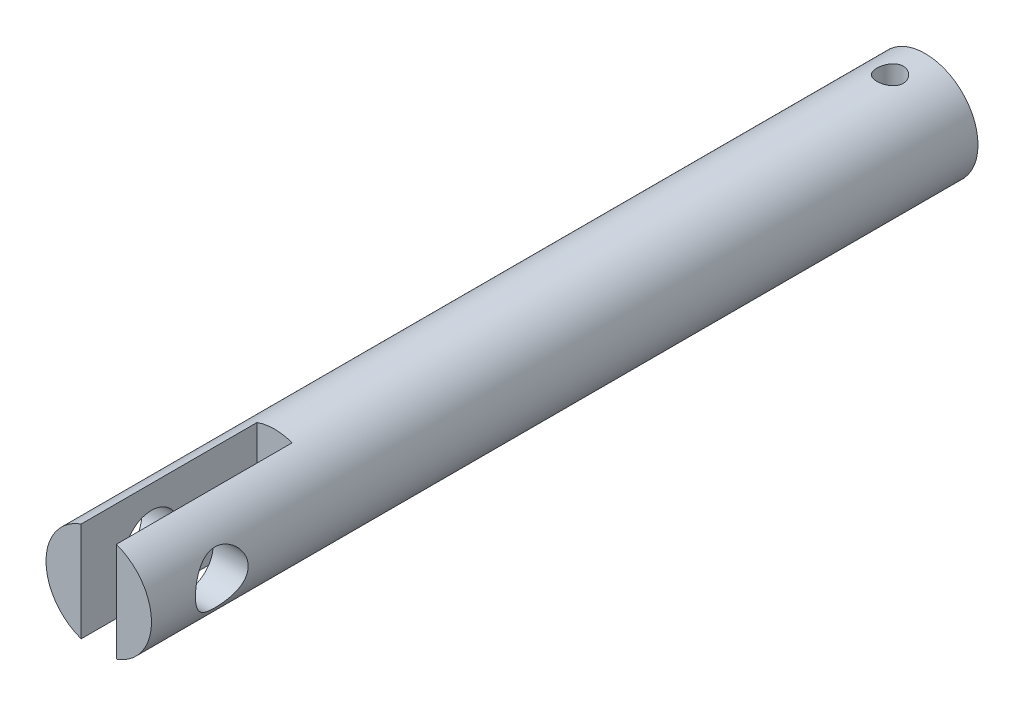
ISO-10303-21;
HEADER;
FILE_DESCRIPTION(('STEP AP214'),'2;1');
FILE_NAME('part.step','',(''),(''),'','','');
FILE_SCHEMA(('AUTOMOTIVE_DESIGN { 1 0 10303 214 1 1 1 1 }'));
ENDSEC;
DATA;
#1=APPLICATION_CONTEXT('core data for automotive mechanical design processes');
#2=APPLICATION_PROTOCOL_DEFINITION('international standard','automotive_design',2000,#1);
#3=PRODUCT_CONTEXT('',#1,'mechanical');
#4=PRODUCT('Part','Part','',(#3));
#5=PRODUCT_RELATED_PRODUCT_CATEGORY('part','',(#4));
#6=PRODUCT_DEFINITION_FORMATION('','',#4);
#7=PRODUCT_DEFINITION_CONTEXT('part definition',#1,'design');
#8=PRODUCT_DEFINITION('design','',#6,#7);
#9=PRODUCT_DEFINITION_SHAPE('','',#8);
#10=(LENGTH_UNIT() NAMED_UNIT(*) SI_UNIT(.MILLI.,.METRE.));
#11=(NAMED_UNIT(*) PLANE_ANGLE_UNIT() SI_UNIT($,.RADIAN.));
#12=(NAMED_UNIT(*) SI_UNIT($,.STERADIAN.) SOLID_ANGLE_UNIT());
#13=UNCERTAINTY_MEASURE_WITH_UNIT(LENGTH_MEASURE(1.E-05),#10,'distance_accuracy_value','');
#14=(GEOMETRIC_REPRESENTATION_CONTEXT(3) GLOBAL_UNCERTAINTY_ASSIGNED_CONTEXT((#13)) GLOBAL_UNIT_ASSIGNED_CONTEXT((#10,
#11,#12)) REPRESENTATION_CONTEXT('',''));
#15=CARTESIAN_POINT('',(0.,0.,0.));
#16=DIRECTION('',(0.,0.,1.));
#17=DIRECTION('',(1.,0.,0.));
#18=AXIS2_PLACEMENT_3D('',#15,#16,#17);
#19=CARTESIAN_POINT('',(0.,0.,74.6125));
#20=DIRECTION('',(0.,0.,1.));
#21=DIRECTION('',(1.,0.,0.));
#22=AXIS2_PLACEMENT_3D('',#19,#20,#21);
#23=PLANE('',#22);
#24=DIRECTION('',(0.,-1.,0.));
#25=VECTOR('',#24,1.);
#26=CARTESIAN_POINT('',(-1.58749999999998,0.,74.6125));
#27=LINE('',#26,#25);
#28=CARTESIAN_POINT('',(-1.58749999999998,4.49012806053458,74.6125));
#29=VERTEX_POINT('',#28);
#30=CARTESIAN_POINT('',(-1.58749999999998,-4.49012806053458,74.6125));
#31=VERTEX_POINT('',#30);
#32=EDGE_CURVE('E139',#29,#31,#27,.T.);
#33=ORIENTED_EDGE('',*,*,#32,.F.);
#34=CARTESIAN_POINT('',(0.,0.,74.6125));
#35=DIRECTION('',(0.,0.,1.));
#36=DIRECTION('',(1.,0.,0.));
#37=AXIS2_PLACEMENT_3D('',#34,#35,#36);
#38=CIRCLE('',#37,4.7625);
#39=EDGE_CURVE('E103',#29,#31,#38,.T.);
#40=ORIENTED_EDGE('',*,*,#39,.T.);
#41=EDGE_LOOP('',(#33,#40));
#42=FACE_BOUND('',#41,.T.);
#43=ADVANCED_FACE('F34',(#42),#23,.T.);
#44=CARTESIAN_POINT('',(0.,0.,74.6125));
#45=DIRECTION('',(0.,0.,-1.));
#46=DIRECTION('',(-1.,0.,0.));
#47=AXIS2_PLACEMENT_3D('',#44,#45,#46);
#48=CYLINDRICAL_SURFACE('',#47,4.7625);
#49=CARTESIAN_POINT('',(-4.7625,0.,65.88125));
#50=CARTESIAN_POINT('',(-4.76249216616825,0.125183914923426,65.8812592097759));
#51=CARTESIAN_POINT('',(-4.75751079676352,0.250522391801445,65.8911803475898));
#52=CARTESIAN_POINT('',(-4.73807236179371,0.497492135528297,65.9304293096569));
#53=CARTESIAN_POINT('',(-4.72359730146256,0.619115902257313,65.9597939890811));
#54=CARTESIAN_POINT('',(-4.68668758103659,0.854710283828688,66.0364928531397));
#55=CARTESIAN_POINT('',(-4.66428387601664,0.968708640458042,66.083757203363));
#56=CARTESIAN_POINT('',(-4.6135713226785,1.18698797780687,66.1945525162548));
#57=CARTESIAN_POINT('',(-4.58526293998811,1.29126972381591,66.2580821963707));
#58=CARTESIAN_POINT('',(-4.52333339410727,1.49425297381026,66.4039754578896));
#59=CARTESIAN_POINT('',(-4.48949442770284,1.59223521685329,66.4872459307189));
#60=CARTESIAN_POINT('',(-4.42102804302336,1.77350605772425,66.668304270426));
#61=CARTESIAN_POINT('',(-4.3864000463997,1.85678345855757,66.7661030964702));
#62=CARTESIAN_POINT('',(-4.31718127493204,2.01275632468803,66.9825384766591));
#63=CARTESIAN_POINT('',(-4.28280163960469,2.08413032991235,67.1022028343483));
#64=CARTESIAN_POINT('',(-4.22162236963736,2.20543809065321,67.3537372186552));
#65=CARTESIAN_POINT('',(-4.19481732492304,2.25538716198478,67.4855984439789));
#66=CARTESIAN_POINT('',(-4.1542779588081,2.32917787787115,67.7497337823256));
#67=CARTESIAN_POINT('',(-4.13985721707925,2.35440344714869,67.8815106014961));
#68=CARTESIAN_POINT('',(-4.12389375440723,2.38226677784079,68.1481496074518));
#69=CARTESIAN_POINT('',(-4.12233830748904,2.38492686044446,68.2830086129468));
#70=CARTESIAN_POINT('',(-4.13172902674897,2.36859910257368,68.5346435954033));
#71=CARTESIAN_POINT('',(-4.14120243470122,2.35216198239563,68.6516534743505));
#72=CARTESIAN_POINT('',(-4.16900269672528,2.30252551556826,68.8809627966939));
#73=CARTESIAN_POINT('',(-4.1873323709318,2.26932082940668,68.9932607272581));
#74=CARTESIAN_POINT('',(-4.23118303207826,2.18648703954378,69.2131643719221));
#75=CARTESIAN_POINT('',(-4.25686158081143,2.13649337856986,69.3205998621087));
#76=CARTESIAN_POINT('',(-4.31252481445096,2.02178051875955,69.5260729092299));
#77=CARTESIAN_POINT('',(-4.34251143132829,1.95705470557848,69.6241062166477));
#78=CARTESIAN_POINT('',(-4.40800707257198,1.80514479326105,69.8210787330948));
#79=CARTESIAN_POINT('',(-4.44373421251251,1.71615367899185,69.9185566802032));
#80=CARTESIAN_POINT('',(-4.51360277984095,1.52294172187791,70.0978137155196));
#81=CARTESIAN_POINT('',(-4.54774344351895,1.41871364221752,70.1795853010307));
#82=CARTESIAN_POINT('',(-4.61252857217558,1.19185492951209,70.328676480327));
#83=CARTESIAN_POINT('',(-4.6429370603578,1.06859448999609,70.3951486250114));
#84=CARTESIAN_POINT('',(-4.69482204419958,0.810735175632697,70.5058685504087));
#85=CARTESIAN_POINT('',(-4.71630562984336,0.676145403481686,70.5501339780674));
#86=CARTESIAN_POINT('',(-4.74641069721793,0.411400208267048,70.6115445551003));
#87=CARTESIAN_POINT('',(-4.75595009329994,0.281800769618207,70.630632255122));
#88=CARTESIAN_POINT('',(-4.7642386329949,0.0209064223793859,70.647237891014));
#89=CARTESIAN_POINT('',(-4.7629928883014,-0.110387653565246,70.644766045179));
#90=CARTESIAN_POINT('',(-4.75038401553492,-0.36012351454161,70.6194453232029));
#91=CARTESIAN_POINT('',(-4.73981253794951,-0.478772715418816,70.5981906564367));
#92=CARTESIAN_POINT('',(-4.71064045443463,-0.71058141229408,70.5384080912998));
#93=CARTESIAN_POINT('',(-4.69203896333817,-0.823740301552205,70.4998782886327));
#94=CARTESIAN_POINT('',(-4.64782498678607,-1.04510349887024,70.4056286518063));
#95=CARTESIAN_POINT('',(-4.62202724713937,-1.1530736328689,70.3494488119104));
#96=CARTESIAN_POINT('',(-4.56590338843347,-1.35841111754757,70.2220126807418));
#97=CARTESIAN_POINT('',(-4.53557534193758,-1.45577392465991,70.1507499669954));
#98=CARTESIAN_POINT('',(-4.46980202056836,-1.64727181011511,69.9870954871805));
#99=CARTESIAN_POINT('',(-4.43414669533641,-1.74015101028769,69.8933160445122));
#100=CARTESIAN_POINT('',(-4.36393570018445,-1.90942036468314,69.6914282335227));
#101=CARTESIAN_POINT('',(-4.32938080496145,-1.98579911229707,69.5833100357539));
#102=CARTESIAN_POINT('',(-4.2636565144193,-2.12337947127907,69.3491985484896));
#103=CARTESIAN_POINT('',(-4.23273211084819,-2.18366696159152,69.2225931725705));
#104=CARTESIAN_POINT('',(-4.18085759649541,-2.28143472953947,68.958991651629));
#105=CARTESIAN_POINT('',(-4.15989464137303,-2.31894439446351,68.8220091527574));
#106=CARTESIAN_POINT('',(-4.13293324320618,-2.36663314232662,68.5556075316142));
#107=CARTESIAN_POINT('',(-4.12569144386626,-2.37909019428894,68.4267246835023));
#108=CARTESIAN_POINT('',(-4.12350000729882,-2.38289105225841,68.1685666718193));
#109=CARTESIAN_POINT('',(-4.12854504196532,-2.37424400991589,68.0392917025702));
#110=CARTESIAN_POINT('',(-4.14903909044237,-2.33821157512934,67.7970049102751));
#111=CARTESIAN_POINT('',(-4.16345118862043,-2.31268975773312,67.683616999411));
#112=CARTESIAN_POINT('',(-4.19983482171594,-2.24593636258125,67.4628569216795));
#113=CARTESIAN_POINT('',(-4.22180878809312,-2.2046997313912,67.3554867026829));
#114=CARTESIAN_POINT('',(-4.27264188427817,-2.10458608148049,67.1418245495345));
#115=CARTESIAN_POINT('',(-4.30186440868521,-2.04471002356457,67.0360897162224));
#116=CARTESIAN_POINT('',(-4.36329131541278,-1.91012262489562,66.8354776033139));
#117=CARTESIAN_POINT('',(-4.39549724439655,-1.8354035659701,66.7406060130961));
#118=CARTESIAN_POINT('',(-4.46394665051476,-1.66259405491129,66.5524240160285));
#119=CARTESIAN_POINT('',(-4.50020523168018,-1.56276696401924,66.4607039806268));
#120=CARTESIAN_POINT('',(-4.56908865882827,-1.34816645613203,66.2949628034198));
#121=CARTESIAN_POINT('',(-4.60171154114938,-1.23338503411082,66.2209512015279));
#122=CARTESIAN_POINT('',(-4.66006004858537,-0.990398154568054,66.0926126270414));
#123=CARTESIAN_POINT('',(-4.68573527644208,-0.862103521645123,66.0384285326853));
#124=CARTESIAN_POINT('',(-4.71657007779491,-0.663253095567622,65.9744198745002));
#125=CARTESIAN_POINT('',(-4.72556504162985,-0.595951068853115,65.9559684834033));
#126=CARTESIAN_POINT('',(-4.74075563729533,-0.45969935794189,65.925002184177));
#127=CARTESIAN_POINT('',(-4.74695297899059,-0.390750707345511,65.9124836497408));
#128=CARTESIAN_POINT('',(-4.75524386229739,-0.268146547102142,65.8957875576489));
#129=CARTESIAN_POINT('',(-4.75795932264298,-0.214701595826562,65.8903416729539));
#130=CARTESIAN_POINT('',(-4.761589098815,-0.107513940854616,65.8830708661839));
#131=CARTESIAN_POINT('',(-4.76250336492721,-0.0537712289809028,65.8812460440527));
#132=CARTESIAN_POINT('',(-4.7625,0.,65.88125));
#133=B_SPLINE_CURVE_WITH_KNOTS('',3,(#49,#50,#51,#52,#53,#54,#55,#56,#57,#58,#59,#60,#61,#62,
#63,#64,#65,#66,#67,#68,#69,#70,#71,#72,#73,#74,#75,#76,#77,#78,#79,#80,#81,#82,#83,#84,#85,#86,
#87,#88,#89,#90,#91,#92,#93,#94,#95,#96,#97,#98,#99,#100,#101,#102,#103,#104,#105,#106,#107,
#108,#109,#110,#111,#112,#113,#114,#115,#116,#117,#118,#119,#120,#121,#122,#123,#124,#125,#126,
#127,#128,#129,#130,#131,#132),.UNSPECIFIED.,.T.,.F.,(4,2,2,2,2,2,2,2,2,2,2,2,2,2,2,2,2,2,2,2,2,
2,2,2,2,2,2,2,2,2,2,2,2,2,2,2,2,2,2,2,2,4),(0.,0.375342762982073,0.751399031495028,
1.12600300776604,1.50057745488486,1.89781281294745,2.29534935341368,2.72371486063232,
3.15177363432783,3.55420641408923,3.9562410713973,4.31019852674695,4.66426876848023,
5.02658634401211,5.38906691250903,5.79750891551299,6.20614554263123,6.63375821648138,
7.06103054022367,7.45291460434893,7.84461294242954,8.20595196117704,8.56733082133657,
8.93904238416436,9.31091254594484,9.71930072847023,10.127970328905,10.5564308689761,
10.9843374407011,11.3711666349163,11.7578281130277,12.1076544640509,12.4575934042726,
12.8310431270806,13.2046875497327,13.6237323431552,14.0430023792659,14.4652368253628,
14.6760580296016,14.8867502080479,15.0479696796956,15.2091936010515),.UNSPECIFIED.);
#134=CARTESIAN_POINT('',(-4.7625,0.,65.88125));
#135=VERTEX_POINT('',#134);
#136=EDGE_CURVE('E84',#135,#135,#133,.T.);
#137=ORIENTED_EDGE('',*,*,#136,.T.);
#138=EDGE_LOOP('',(#137));
#139=FACE_BOUND('',#138,.T.);
#140=CARTESIAN_POINT('',(4.7625,0.,65.88125));
#141=CARTESIAN_POINT('',(4.76249216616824,-0.125183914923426,65.8812592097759));
#142=CARTESIAN_POINT('',(4.75751079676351,-0.250522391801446,65.8911803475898));
#143=CARTESIAN_POINT('',(4.73807236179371,-0.497492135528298,65.9304293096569));
#144=CARTESIAN_POINT('',(4.72359730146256,-0.619115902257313,65.9597939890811));
#145=CARTESIAN_POINT('',(4.68668758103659,-0.854710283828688,66.0364928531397));
#146=CARTESIAN_POINT('',(4.66428387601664,-0.968708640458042,66.083757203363));
#147=CARTESIAN_POINT('',(4.6135713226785,-1.18698797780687,66.1945525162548));
#148=CARTESIAN_POINT('',(4.58526293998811,-1.29126972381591,66.2580821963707));
#149=CARTESIAN_POINT('',(4.52333339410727,-1.49425297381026,66.4039754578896));
#150=CARTESIAN_POINT('',(4.48949442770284,-1.59223521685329,66.4872459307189));
#151=CARTESIAN_POINT('',(4.42102804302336,-1.77350605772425,66.668304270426));
#152=CARTESIAN_POINT('',(4.3864000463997,-1.85678345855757,66.7661030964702));
#153=CARTESIAN_POINT('',(4.31718127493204,-2.01275632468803,66.9825384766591));
#154=CARTESIAN_POINT('',(4.28280163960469,-2.08413032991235,67.1022028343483));
#155=CARTESIAN_POINT('',(4.22162236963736,-2.20543809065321,67.3537372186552));
#156=CARTESIAN_POINT('',(4.19481732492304,-2.25538716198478,67.4855984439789));
#157=CARTESIAN_POINT('',(4.1542779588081,-2.32917787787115,67.7497337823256));
#158=CARTESIAN_POINT('',(4.13985721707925,-2.35440344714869,67.8815106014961));
#159=CARTESIAN_POINT('',(4.12389375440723,-2.38226677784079,68.1481496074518));
#160=CARTESIAN_POINT('',(4.12233830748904,-2.38492686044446,68.2830086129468));
#161=CARTESIAN_POINT('',(4.13172902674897,-2.36859910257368,68.5346435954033));
#162=CARTESIAN_POINT('',(4.14120243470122,-2.35216198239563,68.6516534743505));
#163=CARTESIAN_POINT('',(4.16900269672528,-2.30252551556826,68.8809627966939));
#164=CARTESIAN_POINT('',(4.1873323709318,-2.26932082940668,68.9932607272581));
#165=CARTESIAN_POINT('',(4.23118303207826,-2.18648703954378,69.2131643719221));
#166=CARTESIAN_POINT('',(4.25686158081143,-2.13649337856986,69.3205998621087));
#167=CARTESIAN_POINT('',(4.31252481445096,-2.02178051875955,69.5260729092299));
#168=CARTESIAN_POINT('',(4.34251143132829,-1.95705470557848,69.6241062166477));
#169=CARTESIAN_POINT('',(4.40800707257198,-1.80514479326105,69.8210787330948));
#170=CARTESIAN_POINT('',(4.44373421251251,-1.71615367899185,69.9185566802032));
#171=CARTESIAN_POINT('',(4.51360277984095,-1.52294172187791,70.0978137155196));
#172=CARTESIAN_POINT('',(4.54774344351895,-1.41871364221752,70.1795853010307));
#173=CARTESIAN_POINT('',(4.61252857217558,-1.19185492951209,70.328676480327));
#174=CARTESIAN_POINT('',(4.6429370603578,-1.06859448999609,70.3951486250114));
#175=CARTESIAN_POINT('',(4.69482204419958,-0.810735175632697,70.5058685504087));
#176=CARTESIAN_POINT('',(4.71630562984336,-0.676145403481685,70.5501339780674));
#177=CARTESIAN_POINT('',(4.74641069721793,-0.411400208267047,70.6115445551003));
#178=CARTESIAN_POINT('',(4.75595009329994,-0.281800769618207,70.630632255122));
#179=CARTESIAN_POINT('',(4.7642386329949,-0.020906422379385,70.647237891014));
#180=CARTESIAN_POINT('',(4.7629928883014,0.110387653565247,70.644766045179));
#181=CARTESIAN_POINT('',(4.75038401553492,0.360123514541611,70.6194453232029));
#182=CARTESIAN_POINT('',(4.73981253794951,0.478772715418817,70.5981906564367));
#183=CARTESIAN_POINT('',(4.71064045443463,0.710581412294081,70.5384080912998));
#184=CARTESIAN_POINT('',(4.69203896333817,0.823740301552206,70.4998782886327));
#185=CARTESIAN_POINT('',(4.64782498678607,1.04510349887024,70.4056286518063));
#186=CARTESIAN_POINT('',(4.62202724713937,1.1530736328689,70.3494488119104));
#187=CARTESIAN_POINT('',(4.56590338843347,1.35841111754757,70.2220126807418));
#188=CARTESIAN_POINT('',(4.53557534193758,1.45577392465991,70.1507499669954));
#189=CARTESIAN_POINT('',(4.46980202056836,1.64727181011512,69.9870954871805));
#190=CARTESIAN_POINT('',(4.4341466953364,1.74015101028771,69.8933160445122));
#191=CARTESIAN_POINT('',(4.36393570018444,1.90942036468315,69.6914282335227));
#192=CARTESIAN_POINT('',(4.32938080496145,1.98579911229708,69.5833100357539));
#193=CARTESIAN_POINT('',(4.2636565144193,2.12337947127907,69.3491985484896));
#194=CARTESIAN_POINT('',(4.23273211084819,2.18366696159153,69.2225931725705));
#195=CARTESIAN_POINT('',(4.18085759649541,2.28143472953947,68.958991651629));
#196=CARTESIAN_POINT('',(4.15989464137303,2.31894439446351,68.8220091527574));
#197=CARTESIAN_POINT('',(4.13293324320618,2.36663314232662,68.5556075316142));
#198=CARTESIAN_POINT('',(4.12569144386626,2.37909019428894,68.4267246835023));
#199=CARTESIAN_POINT('',(4.12350000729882,2.38289105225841,68.1685666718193));
#200=CARTESIAN_POINT('',(4.12854504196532,2.37424400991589,68.0392917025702));
#201=CARTESIAN_POINT('',(4.14903909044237,2.33821157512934,67.7970049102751));
#202=CARTESIAN_POINT('',(4.16345118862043,2.31268975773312,67.683616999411));
#203=CARTESIAN_POINT('',(4.19983482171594,2.24593636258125,67.4628569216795));
#204=CARTESIAN_POINT('',(4.22180878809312,2.2046997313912,67.3554867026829));
#205=CARTESIAN_POINT('',(4.27264188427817,2.10458608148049,67.1418245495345));
#206=CARTESIAN_POINT('',(4.30186440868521,2.04471002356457,67.0360897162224));
#207=CARTESIAN_POINT('',(4.36329131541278,1.91012262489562,66.8354776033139));
#208=CARTESIAN_POINT('',(4.39549724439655,1.8354035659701,66.7406060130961));
#209=CARTESIAN_POINT('',(4.46394665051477,1.66259405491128,66.5524240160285));
#210=CARTESIAN_POINT('',(4.50020523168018,1.56276696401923,66.4607039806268));
#211=CARTESIAN_POINT('',(4.56908865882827,1.34816645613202,66.2949628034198));
#212=CARTESIAN_POINT('',(4.60171154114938,1.23338503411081,66.2209512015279));
#213=CARTESIAN_POINT('',(4.66006004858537,0.990398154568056,66.0926126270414));
#214=CARTESIAN_POINT('',(4.68573527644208,0.862103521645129,66.0384285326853));
#215=CARTESIAN_POINT('',(4.71657007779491,0.66325309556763,65.9744198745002));
#216=CARTESIAN_POINT('',(4.72556504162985,0.595951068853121,65.9559684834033));
#217=CARTESIAN_POINT('',(4.74075563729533,0.459699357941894,65.925002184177));
#218=CARTESIAN_POINT('',(4.74695297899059,0.390750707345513,65.9124836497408));
#219=CARTESIAN_POINT('',(4.75524386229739,0.268146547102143,65.8957875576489));
#220=CARTESIAN_POINT('',(4.75795932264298,0.214701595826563,65.8903416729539));
#221=CARTESIAN_POINT('',(4.761589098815,0.107513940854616,65.8830708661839));
#222=CARTESIAN_POINT('',(4.7625033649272,0.053771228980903,65.8812460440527));
#223=CARTESIAN_POINT('',(4.7625,0.,65.88125));
#224=B_SPLINE_CURVE_WITH_KNOTS('',3,(#140,#141,#142,#143,#144,#145,#146,#147,#148,#149,#150,
#151,#152,#153,#154,#155,#156,#157,#158,#159,#160,#161,#162,#163,#164,#165,#166,#167,#168,#169,
#170,#171,#172,#173,#174,#175,#176,#177,#178,#179,#180,#181,#182,#183,#184,#185,#186,#187,#188,
#189,#190,#191,#192,#193,#194,#195,#196,#197,#198,#199,#200,#201,#202,#203,#204,#205,#206,#207,
#208,#209,#210,#211,#212,#213,#214,#215,#216,#217,#218,#219,#220,#221,#222,#223),.UNSPECIFIED.,
.T.,.F.,(4,2,2,2,2,2,2,2,2,2,2,2,2,2,2,2,2,2,2,2,2,2,2,2,2,2,2,2,2,2,2,2,2,2,2,2,2,2,2,2,2,4),
(0.,0.375342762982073,0.751399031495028,1.12600300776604,1.50057745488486,1.89781281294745,
2.29534935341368,2.72371486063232,3.15177363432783,3.55420641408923,3.9562410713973,
4.31019852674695,4.66426876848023,5.02658634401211,5.38906691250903,5.79750891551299,
6.20614554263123,6.63375821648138,7.06103054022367,7.45291460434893,7.84461294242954,
8.20595196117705,8.56733082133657,8.93904238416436,9.31091254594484,9.71930072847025,
10.127970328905,10.5564308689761,10.9843374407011,11.3711666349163,11.7578281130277,
12.1076544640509,12.4575934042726,12.8310431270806,13.2046875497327,13.6237323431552,
14.0430023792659,14.4652368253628,14.6760580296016,14.8867502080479,15.0479696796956,
15.2091936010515),.UNSPECIFIED.);
#225=CARTESIAN_POINT('',(4.7625,0.,65.88125));
#226=VERTEX_POINT('',#225);
#227=EDGE_CURVE('E150',#226,#226,#224,.T.);
#228=ORIENTED_EDGE('',*,*,#227,.T.);
#229=EDGE_LOOP('',(#228));
#230=FACE_BOUND('',#229,.T.);
#231=CARTESIAN_POINT('',(0.,-4.7625,4.365625));
#232=CARTESIAN_POINT('',(0.065782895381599,-4.76249888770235,4.36562315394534));
#233=CARTESIAN_POINT('',(0.131586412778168,-4.76112346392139,4.3601548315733));
#234=CARTESIAN_POINT('',(0.26130751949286,-4.75576990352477,4.33845878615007));
#235=CARTESIAN_POINT('',(0.325224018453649,-4.751790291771,4.32222496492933));
#236=CARTESIAN_POINT('',(0.449279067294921,-4.74166903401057,4.27955134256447));
#237=CARTESIAN_POINT('',(0.509422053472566,-4.73552998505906,4.25312379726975));
#238=CARTESIAN_POINT('',(0.624421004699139,-4.72174366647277,4.19085602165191));
#239=CARTESIAN_POINT('',(0.679276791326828,-4.71409634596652,4.15501547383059));
#240=CARTESIAN_POINT('',(0.783274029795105,-4.69794759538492,4.07415937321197));
#241=CARTESIAN_POINT('',(0.832291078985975,-4.68943298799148,4.02898643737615));
#242=CARTESIAN_POINT('',(0.922138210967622,-4.67259685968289,3.93108481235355));
#243=CARTESIAN_POINT('',(0.962967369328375,-4.66427536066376,3.87835527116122));
#244=CARTESIAN_POINT('',(1.03586481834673,-4.64863478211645,3.76587128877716));
#245=CARTESIAN_POINT('',(1.06779394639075,-4.64133243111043,3.70602412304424));
#246=CARTESIAN_POINT('',(1.12109004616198,-4.62874911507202,3.58159969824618));
#247=CARTESIAN_POINT('',(1.14245870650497,-4.62346782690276,3.51702319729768));
#248=CARTESIAN_POINT('',(1.17360290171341,-4.61566003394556,3.38634109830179));
#249=CARTESIAN_POINT('',(1.18360211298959,-4.61308046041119,3.32029205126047));
#250=CARTESIAN_POINT('',(1.19242028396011,-4.61080931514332,3.18740744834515));
#251=CARTESIAN_POINT('',(1.19124106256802,-4.61111727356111,3.12057202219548));
#252=CARTESIAN_POINT('',(1.17791430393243,-4.61453869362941,2.98972620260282));
#253=CARTESIAN_POINT('',(1.16603330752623,-4.61758397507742,2.92568660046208));
#254=CARTESIAN_POINT('',(1.13206544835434,-4.62602825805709,2.80053966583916));
#255=CARTESIAN_POINT('',(1.1099778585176,-4.6314274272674,2.73943254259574));
#256=CARTESIAN_POINT('',(1.05599664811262,-4.64403371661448,2.62117044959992));
#257=CARTESIAN_POINT('',(1.02400629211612,-4.65125853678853,2.56406160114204));
#258=CARTESIAN_POINT('',(0.95119529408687,-4.66669207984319,2.45592702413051));
#259=CARTESIAN_POINT('',(0.910373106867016,-4.67490097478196,2.40490236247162));
#260=CARTESIAN_POINT('',(0.819676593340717,-4.69166480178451,2.30885713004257));
#261=CARTESIAN_POINT('',(0.769577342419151,-4.7002229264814,2.2640492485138));
#262=CARTESIAN_POINT('',(0.662473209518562,-4.71650985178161,2.18343063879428));
#263=CARTESIAN_POINT('',(0.60546811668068,-4.72423862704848,2.14762018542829));
#264=CARTESIAN_POINT('',(0.485866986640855,-4.73803449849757,2.08593484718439));
#265=CARTESIAN_POINT('',(0.423252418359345,-4.74409579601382,2.06009451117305));
#266=CARTESIAN_POINT('',(0.294382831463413,-4.75383159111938,2.01936563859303));
#267=CARTESIAN_POINT('',(0.228128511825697,-4.75750654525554,2.0044750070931));
#268=CARTESIAN_POINT('',(0.095678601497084,-4.76198802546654,1.98639305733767));
#269=CARTESIAN_POINT('',(0.0295248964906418,-4.76286554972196,1.98291209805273));
#270=CARTESIAN_POINT('',(-0.102419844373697,-4.7618555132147,1.98695389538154));
#271=CARTESIAN_POINT('',(-0.168210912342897,-4.75996820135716,1.99447566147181));
#272=CARTESIAN_POINT('',(-0.29655632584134,-4.75368605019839,2.02007065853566));
#273=CARTESIAN_POINT('',(-0.359144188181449,-4.74932878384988,2.03798587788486));
#274=CARTESIAN_POINT('',(-0.480422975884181,-4.73859785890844,2.08367874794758));
#275=CARTESIAN_POINT('',(-0.539113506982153,-4.73222399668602,2.11145739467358));
#276=CARTESIAN_POINT('',(-0.652083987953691,-4.71799688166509,2.17664992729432));
#277=CARTESIAN_POINT('',(-0.70626719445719,-4.71011938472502,2.21422603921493));
#278=CARTESIAN_POINT('',(-0.807661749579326,-4.69379704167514,2.29773949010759));
#279=CARTESIAN_POINT('',(-0.854871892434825,-4.68535209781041,2.34367827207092));
#280=CARTESIAN_POINT('',(-0.94217376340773,-4.66859109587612,2.44395780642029));
#281=CARTESIAN_POINT('',(-0.982062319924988,-4.66028328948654,2.49847711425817));
#282=CARTESIAN_POINT('',(-1.05212416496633,-4.64496847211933,2.61360652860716));
#283=CARTESIAN_POINT('',(-1.08229788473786,-4.63796140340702,2.6742163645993));
#284=CARTESIAN_POINT('',(-1.13184894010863,-4.6261186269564,2.79948141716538));
#285=CARTESIAN_POINT('',(-1.15129023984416,-4.6212700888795,2.86411005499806));
#286=CARTESIAN_POINT('',(-1.17899311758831,-4.61428103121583,2.99585827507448));
#287=CARTESIAN_POINT('',(-1.18725714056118,-4.61213991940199,3.06297730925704));
#288=CARTESIAN_POINT('',(-1.19224313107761,-4.61085327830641,3.19573356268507));
#289=CARTESIAN_POINT('',(-1.18928983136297,-4.61162346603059,3.26135796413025));
#290=CARTESIAN_POINT('',(-1.17266821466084,-4.61587777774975,3.39114121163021));
#291=CARTESIAN_POINT('',(-1.15900011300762,-4.61936184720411,3.45530008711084));
#292=CARTESIAN_POINT('',(-1.12151423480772,-4.62860438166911,3.57997796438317));
#293=CARTESIAN_POINT('',(-1.09775736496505,-4.63434918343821,3.64051636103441));
#294=CARTESIAN_POINT('',(-1.04081652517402,-4.64746781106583,3.75679127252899));
#295=CARTESIAN_POINT('',(-1.00763124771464,-4.65484186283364,3.81252711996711));
#296=CARTESIAN_POINT('',(-0.931757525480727,-4.67062847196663,3.91918398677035));
#297=CARTESIAN_POINT('',(-0.888843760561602,-4.67906310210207,3.96994147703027));
#298=CARTESIAN_POINT('',(-0.795170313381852,-4.69588871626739,4.06364046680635));
#299=CARTESIAN_POINT('',(-0.744408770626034,-4.70427968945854,4.10658010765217));
#300=CARTESIAN_POINT('',(-0.635371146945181,-4.72025389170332,4.18418272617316));
#301=CARTESIAN_POINT('',(-0.576975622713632,-4.72781973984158,4.21868172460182));
#302=CARTESIAN_POINT('',(-0.45502993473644,-4.74110784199,4.27731829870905));
#303=CARTESIAN_POINT('',(-0.391483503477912,-4.74683141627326,4.30146329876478));
#304=CARTESIAN_POINT('',(-0.273375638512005,-4.75494397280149,4.33512264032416));
#305=CARTESIAN_POINT('',(-0.219376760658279,-4.75775801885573,4.34653629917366));
#306=CARTESIAN_POINT('',(-0.110256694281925,-4.76153642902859,4.36178796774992));
#307=CARTESIAN_POINT('',(-0.0551355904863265,-4.76250093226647,4.36562654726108));
#308=CARTESIAN_POINT('',(0.,-4.7625,4.365625));
#309=B_SPLINE_CURVE_WITH_KNOTS('',3,(#231,#232,#233,#234,#235,#236,#237,#238,#239,#240,#241,
#242,#243,#244,#245,#246,#247,#248,#249,#250,#251,#252,#253,#254,#255,#256,#257,#258,#259,#260,
#261,#262,#263,#264,#265,#266,#267,#268,#269,#270,#271,#272,#273,#274,#275,#276,#277,#278,#279,
#280,#281,#282,#283,#284,#285,#286,#287,#288,#289,#290,#291,#292,#293,#294,#295,#296,#297,#298,
#299,#300,#301,#302,#303,#304,#305,#306,#307,#308),.UNSPECIFIED.,.T.,.F.,(4,2,2,2,2,2,2,2,2,2,2,
2,2,2,2,2,2,2,2,2,2,2,2,2,2,2,2,2,2,2,2,2,2,2,2,2,2,2,4),(0.,0.197146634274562,
0.394405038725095,0.591427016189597,0.788455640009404,0.989127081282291,1.18982116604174,
1.39349676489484,1.59713978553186,1.79670309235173,1.99623392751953,2.19092856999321,
2.38563708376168,2.58231106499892,2.77901948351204,2.98133691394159,3.18366052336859,
3.38667906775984,3.5896587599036,3.78744407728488,3.9852115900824,4.18004842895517,
4.37490494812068,4.57321910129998,4.77156750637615,4.97478454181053,5.17799255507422,
5.37997602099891,5.58191529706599,5.77805375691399,5.97418827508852,6.16915517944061,
6.36414913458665,6.56422976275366,6.76435789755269,6.96811047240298,7.17171670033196,
7.33696655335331,7.50220397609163),.UNSPECIFIED.);
#310=CARTESIAN_POINT('',(0.,-4.7625,4.365625));
#311=VERTEX_POINT('',#310);
#312=EDGE_CURVE('E110',#311,#311,#309,.T.);
#313=ORIENTED_EDGE('',*,*,#312,.T.);
#314=EDGE_LOOP('',(#313));
#315=FACE_BOUND('',#314,.T.);
#316=CARTESIAN_POINT('',(0.,4.7625,4.365625));
#317=CARTESIAN_POINT('',(-0.0657828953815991,4.76249888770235,4.36562315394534));
#318=CARTESIAN_POINT('',(-0.131586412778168,4.76112346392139,4.3601548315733));
#319=CARTESIAN_POINT('',(-0.26130751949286,4.75576990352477,4.33845878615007));
#320=CARTESIAN_POINT('',(-0.325224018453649,4.751790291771,4.32222496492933));
#321=CARTESIAN_POINT('',(-0.449279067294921,4.74166903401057,4.27955134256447));
#322=CARTESIAN_POINT('',(-0.509422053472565,4.73552998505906,4.25312379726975));
#323=CARTESIAN_POINT('',(-0.624421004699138,4.72174366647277,4.19085602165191));
#324=CARTESIAN_POINT('',(-0.679276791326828,4.71409634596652,4.15501547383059));
#325=CARTESIAN_POINT('',(-0.783274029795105,4.69794759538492,4.07415937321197));
#326=CARTESIAN_POINT('',(-0.832291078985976,4.68943298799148,4.02898643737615));
#327=CARTESIAN_POINT('',(-0.922138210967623,4.67259685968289,3.93108481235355));
#328=CARTESIAN_POINT('',(-0.962967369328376,4.66427536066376,3.87835527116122));
#329=CARTESIAN_POINT('',(-1.03586481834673,4.64863478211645,3.76587128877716));
#330=CARTESIAN_POINT('',(-1.06779394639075,4.64133243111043,3.70602412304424));
#331=CARTESIAN_POINT('',(-1.12109004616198,4.62874911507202,3.58159969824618));
#332=CARTESIAN_POINT('',(-1.14245870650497,4.62346782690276,3.51702319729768));
#333=CARTESIAN_POINT('',(-1.17360290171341,4.61566003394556,3.38634109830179));
#334=CARTESIAN_POINT('',(-1.18360211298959,4.61308046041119,3.32029205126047));
#335=CARTESIAN_POINT('',(-1.19242028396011,4.61080931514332,3.18740744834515));
#336=CARTESIAN_POINT('',(-1.19124106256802,4.61111727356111,3.12057202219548));
#337=CARTESIAN_POINT('',(-1.17791430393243,4.61453869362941,2.98972620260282));
#338=CARTESIAN_POINT('',(-1.16603330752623,4.61758397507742,2.92568660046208));
#339=CARTESIAN_POINT('',(-1.13206544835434,4.62602825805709,2.80053966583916));
#340=CARTESIAN_POINT('',(-1.1099778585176,4.6314274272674,2.73943254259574));
#341=CARTESIAN_POINT('',(-1.05599664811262,4.64403371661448,2.62117044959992));
#342=CARTESIAN_POINT('',(-1.02400629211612,4.65125853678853,2.56406160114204));
#343=CARTESIAN_POINT('',(-0.95119529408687,4.66669207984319,2.45592702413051));
#344=CARTESIAN_POINT('',(-0.910373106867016,4.67490097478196,2.40490236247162));
#345=CARTESIAN_POINT('',(-0.819676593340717,4.69166480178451,2.30885713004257));
#346=CARTESIAN_POINT('',(-0.769577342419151,4.7002229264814,2.2640492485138));
#347=CARTESIAN_POINT('',(-0.662473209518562,4.71650985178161,2.18343063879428));
#348=CARTESIAN_POINT('',(-0.60546811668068,4.72423862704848,2.14762018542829));
#349=CARTESIAN_POINT('',(-0.485866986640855,4.73803449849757,2.08593484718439));
#350=CARTESIAN_POINT('',(-0.423252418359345,4.74409579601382,2.06009451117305));
#351=CARTESIAN_POINT('',(-0.294382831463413,4.75383159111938,2.01936563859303));
#352=CARTESIAN_POINT('',(-0.228128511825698,4.75750654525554,2.0044750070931));
#353=CARTESIAN_POINT('',(-0.095678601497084,4.76198802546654,1.98639305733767));
#354=CARTESIAN_POINT('',(-0.0295248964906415,4.76286554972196,1.98291209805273));
#355=CARTESIAN_POINT('',(0.102419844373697,4.7618555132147,1.98695389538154));
#356=CARTESIAN_POINT('',(0.168210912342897,4.75996820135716,1.99447566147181));
#357=CARTESIAN_POINT('',(0.29655632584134,4.75368605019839,2.02007065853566));
#358=CARTESIAN_POINT('',(0.359144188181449,4.74932878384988,2.03798587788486));
#359=CARTESIAN_POINT('',(0.480422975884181,4.73859785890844,2.08367874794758));
#360=CARTESIAN_POINT('',(0.539113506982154,4.73222399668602,2.11145739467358));
#361=CARTESIAN_POINT('',(0.652083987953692,4.71799688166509,2.17664992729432));
#362=CARTESIAN_POINT('',(0.706267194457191,4.71011938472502,2.21422603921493));
#363=CARTESIAN_POINT('',(0.807661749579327,4.69379704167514,2.2977394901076));
#364=CARTESIAN_POINT('',(0.854871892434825,4.68535209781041,2.34367827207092));
#365=CARTESIAN_POINT('',(0.94217376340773,4.66859109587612,2.44395780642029));
#366=CARTESIAN_POINT('',(0.982062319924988,4.66028328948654,2.49847711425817));
#367=CARTESIAN_POINT('',(1.05212416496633,4.64496847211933,2.61360652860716));
#368=CARTESIAN_POINT('',(1.08229788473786,4.63796140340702,2.6742163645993));
#369=CARTESIAN_POINT('',(1.13184894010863,4.6261186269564,2.79948141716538));
#370=CARTESIAN_POINT('',(1.15129023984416,4.6212700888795,2.86411005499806));
#371=CARTESIAN_POINT('',(1.17899311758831,4.61428103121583,2.99585827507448));
#372=CARTESIAN_POINT('',(1.18725714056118,4.61213991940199,3.06297730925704));
#373=CARTESIAN_POINT('',(1.19224313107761,4.61085327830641,3.19573356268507));
#374=CARTESIAN_POINT('',(1.18928983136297,4.61162346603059,3.26135796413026));
#375=CARTESIAN_POINT('',(1.17266821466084,4.61587777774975,3.39114121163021));
#376=CARTESIAN_POINT('',(1.15900011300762,4.61936184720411,3.45530008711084));
#377=CARTESIAN_POINT('',(1.12151423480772,4.62860438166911,3.57997796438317));
#378=CARTESIAN_POINT('',(1.09775736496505,4.63434918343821,3.64051636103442));
#379=CARTESIAN_POINT('',(1.04081652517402,4.64746781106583,3.75679127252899));
#380=CARTESIAN_POINT('',(1.00763124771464,4.65484186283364,3.81252711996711));
#381=CARTESIAN_POINT('',(0.931757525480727,4.67062847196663,3.91918398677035));
#382=CARTESIAN_POINT('',(0.888843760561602,4.67906310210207,3.96994147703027));
#383=CARTESIAN_POINT('',(0.795170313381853,4.69588871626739,4.06364046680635));
#384=CARTESIAN_POINT('',(0.744408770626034,4.70427968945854,4.10658010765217));
#385=CARTESIAN_POINT('',(0.635371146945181,4.72025389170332,4.18418272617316));
#386=CARTESIAN_POINT('',(0.576975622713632,4.72781973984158,4.21868172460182));
#387=CARTESIAN_POINT('',(0.45502993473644,4.74110784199,4.27731829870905));
#388=CARTESIAN_POINT('',(0.391483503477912,4.74683141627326,4.30146329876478));
#389=CARTESIAN_POINT('',(0.273375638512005,4.75494397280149,4.33512264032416));
#390=CARTESIAN_POINT('',(0.219376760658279,4.75775801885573,4.34653629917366));
#391=CARTESIAN_POINT('',(0.110256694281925,4.76153642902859,4.36178796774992));
#392=CARTESIAN_POINT('',(0.0551355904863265,4.76250093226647,4.36562654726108));
#393=CARTESIAN_POINT('',(0.,4.7625,4.365625));
#394=B_SPLINE_CURVE_WITH_KNOTS('',3,(#316,#317,#318,#319,#320,#321,#322,#323,#324,#325,#326,
#327,#328,#329,#330,#331,#332,#333,#334,#335,#336,#337,#338,#339,#340,#341,#342,#343,#344,#345,
#346,#347,#348,#349,#350,#351,#352,#353,#354,#355,#356,#357,#358,#359,#360,#361,#362,#363,#364,
#365,#366,#367,#368,#369,#370,#371,#372,#373,#374,#375,#376,#377,#378,#379,#380,#381,#382,#383,
#384,#385,#386,#387,#388,#389,#390,#391,#392,#393),.UNSPECIFIED.,.T.,.F.,(4,2,2,2,2,2,2,2,2,2,2,
2,2,2,2,2,2,2,2,2,2,2,2,2,2,2,2,2,2,2,2,2,2,2,2,2,2,2,4),(0.,0.197146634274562,
0.394405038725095,0.591427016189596,0.788455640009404,0.989127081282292,1.18982116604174,
1.39349676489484,1.59713978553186,1.79670309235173,1.99623392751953,2.19092856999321,
2.38563708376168,2.58231106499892,2.77901948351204,2.98133691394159,3.18366052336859,
3.38667906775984,3.5896587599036,3.78744407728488,3.9852115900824,4.18004842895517,
4.37490494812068,4.57321910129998,4.77156750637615,4.97478454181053,5.17799255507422,
5.37997602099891,5.58191529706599,5.77805375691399,5.97418827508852,6.16915517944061,
6.36414913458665,6.56422976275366,6.76435789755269,6.96811047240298,7.17171670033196,
7.33696655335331,7.50220397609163),.UNSPECIFIED.);
#395=CARTESIAN_POINT('',(0.,4.7625,4.365625));
#396=VERTEX_POINT('',#395);
#397=EDGE_CURVE('E104',#396,#396,#394,.T.);
#398=ORIENTED_EDGE('',*,*,#397,.T.);
#399=EDGE_LOOP('',(#398));
#400=FACE_BOUND('',#399,.T.);
#401=ORIENTED_EDGE('',*,*,#39,.F.);
#402=DIRECTION('',(0.,0.,-1.));
#403=VECTOR('',#402,1.);
#404=CARTESIAN_POINT('',(-1.58749999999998,4.49012806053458,74.6125));
#405=LINE('',#404,#403);
#406=CARTESIAN_POINT('',(-1.58749999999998,4.49012806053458,58.7375));
#407=VERTEX_POINT('',#406);
#408=EDGE_CURVE('E93',#29,#407,#405,.T.);
#409=ORIENTED_EDGE('',*,*,#408,.T.);
#410=CARTESIAN_POINT('',(0.,0.,58.7375));
#411=DIRECTION('',(0.,0.,-1.));
#412=DIRECTION('',(-1.,0.,0.));
#413=AXIS2_PLACEMENT_3D('',#410,#411,#412);
#414=CIRCLE('',#413,4.7625);
#415=CARTESIAN_POINT('',(1.58750000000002,4.49012806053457,58.7375));
#416=VERTEX_POINT('',#415);
#417=EDGE_CURVE('E44',#407,#416,#414,.T.);
#418=ORIENTED_EDGE('',*,*,#417,.T.);
#419=DIRECTION('',(0.,0.,-1.));
#420=VECTOR('',#419,1.);
#421=CARTESIAN_POINT('',(1.5875,4.49012806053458,74.6125));
#422=LINE('',#421,#420);
#423=CARTESIAN_POINT('',(1.5875,4.49012806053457,74.6125));
#424=VERTEX_POINT('',#423);
#425=EDGE_CURVE('E83',#416,#424,#422,.F.);
#426=ORIENTED_EDGE('',*,*,#425,.T.);
#427=CARTESIAN_POINT('',(1.5875,-4.49012806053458,74.6125));
#428=VERTEX_POINT('',#427);
#429=EDGE_CURVE('E90',#428,#424,#38,.T.);
#430=ORIENTED_EDGE('',*,*,#429,.F.);
#431=DIRECTION('',(0.,0.,-1.));
#432=VECTOR('',#431,1.);
#433=CARTESIAN_POINT('',(1.5875,-4.49012806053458,74.6125));
#434=LINE('',#433,#432);
#435=CARTESIAN_POINT('',(1.58750000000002,-4.49012806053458,58.7375));
#436=VERTEX_POINT('',#435);
#437=EDGE_CURVE('E51',#428,#436,#434,.T.);
#438=ORIENTED_EDGE('',*,*,#437,.T.);
#439=CARTESIAN_POINT('',(-1.58749999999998,-4.49012806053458,58.7375));
#440=VERTEX_POINT('',#439);
#441=EDGE_CURVE('E11',#436,#440,#414,.T.);
#442=ORIENTED_EDGE('',*,*,#441,.T.);
#443=DIRECTION('',(0.,0.,-1.));
#444=VECTOR('',#443,1.);
#445=CARTESIAN_POINT('',(-1.58749999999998,-4.49012806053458,74.6125));
#446=LINE('',#445,#444);
#447=EDGE_CURVE('E91',#440,#31,#446,.F.);
#448=ORIENTED_EDGE('',*,*,#447,.T.);
#449=EDGE_LOOP('',(#401,#409,#418,#426,#430,#438,#442,#448));
#450=FACE_BOUND('',#449,.T.);
#451=CARTESIAN_POINT('',(0.,0.,0.));
#452=DIRECTION('',(0.,0.,1.));
#453=DIRECTION('',(1.,0.,0.));
#454=AXIS2_PLACEMENT_3D('',#451,#452,#453);
#455=CIRCLE('',#454,4.7625);
#456=CARTESIAN_POINT('',(4.7625,0.,0.));
#457=VERTEX_POINT('',#456);
#458=EDGE_CURVE('E99',#457,#457,#455,.T.);
#459=ORIENTED_EDGE('',*,*,#458,.T.);
#460=EDGE_LOOP('',(#459));
#461=FACE_BOUND('',#460,.T.);
#462=ADVANCED_FACE('F36',(#139,#230,#315,#400,#450,#461),#48,.T.);
#463=DIRECTION('',(0.,1.,0.));
#464=VECTOR('',#463,1.);
#465=CARTESIAN_POINT('',(1.5875,0.,74.6125));
#466=LINE('',#465,#464);
#467=EDGE_CURVE('E141',#428,#424,#466,.T.);
#468=ORIENTED_EDGE('',*,*,#467,.F.);
#469=ORIENTED_EDGE('',*,*,#429,.T.);
#470=EDGE_LOOP('',(#468,#469));
#471=FACE_BOUND('',#470,.T.);
#472=ADVANCED_FACE('F125',(#471),#23,.T.);
#473=CARTESIAN_POINT('',(0.,0.,0.));
#474=DIRECTION('',(0.,0.,1.));
#475=DIRECTION('',(1.,0.,0.));
#476=AXIS2_PLACEMENT_3D('',#473,#474,#475);
#477=PLANE('',#476);
#478=ORIENTED_EDGE('',*,*,#458,.F.);
#479=EDGE_LOOP('',(#478));
#480=FACE_BOUND('',#479,.T.);
#481=ADVANCED_FACE('F119',(#480),#477,.F.);
#482=CARTESIAN_POINT('',(0.,-4.7625,3.175));
#483=DIRECTION('',(0.,1.,0.));
#484=DIRECTION('',(0.,0.,1.));
#485=AXIS2_PLACEMENT_3D('',#482,#483,#484);
#486=CYLINDRICAL_SURFACE('',#485,1.190625);
#487=ORIENTED_EDGE('',*,*,#397,.F.);
#488=EDGE_LOOP('',(#487));
#489=FACE_BOUND('',#488,.T.);
#490=ORIENTED_EDGE('',*,*,#312,.F.);
#491=EDGE_LOOP('',(#490));
#492=FACE_BOUND('',#491,.T.);
#493=ADVANCED_FACE('F114',(#489,#492),#486,.F.);
#494=CARTESIAN_POINT('',(-1.58749999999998,-4.7625,58.7375));
#495=DIRECTION('',(0.,0.,-1.));
#496=DIRECTION('',(-1.,0.,0.));
#497=AXIS2_PLACEMENT_3D('',#494,#495,#496);
#498=PLANE('',#497);
#499=DIRECTION('',(0.,1.,0.));
#500=VECTOR('',#499,1.);
#501=CARTESIAN_POINT('',(-1.58749999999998,-4.7625,58.7375));
#502=LINE('',#501,#500);
#503=EDGE_CURVE('E78',#440,#407,#502,.T.);
#504=ORIENTED_EDGE('',*,*,#503,.F.);
#505=ORIENTED_EDGE('',*,*,#441,.F.);
#506=DIRECTION('',(0.,1.,0.));
#507=VECTOR('',#506,1.);
#508=CARTESIAN_POINT('',(1.58750000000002,-4.7625,58.7375));
#509=LINE('',#508,#507);
#510=EDGE_CURVE('E77',#436,#416,#509,.T.);
#511=ORIENTED_EDGE('',*,*,#510,.T.);
#512=ORIENTED_EDGE('',*,*,#417,.F.);
#513=EDGE_LOOP('',(#504,#505,#511,#512));
#514=FACE_BOUND('',#513,.T.);
#515=ADVANCED_FACE('F76',(#514),#498,.F.);
#516=CARTESIAN_POINT('',(-1.58749999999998,-4.7625,74.6125));
#517=DIRECTION('',(-1.,0.,0.));
#518=DIRECTION('',(0.,0.,1.));
#519=AXIS2_PLACEMENT_3D('',#516,#517,#518);
#520=PLANE('',#519);
#521=CARTESIAN_POINT('',(-1.58749999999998,0.,68.2625));
#522=DIRECTION('',(-1.,0.,0.));
#523=DIRECTION('',(0.,0.,1.));
#524=AXIS2_PLACEMENT_3D('',#521,#522,#523);
#525=CIRCLE('',#524,2.38125000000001);
#526=CARTESIAN_POINT('',(-1.58749999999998,0.,70.64375));
#527=VERTEX_POINT('',#526);
#528=EDGE_CURVE('E172',#527,#527,#525,.T.);
#529=ORIENTED_EDGE('',*,*,#528,.T.);
#530=EDGE_LOOP('',(#529));
#531=FACE_BOUND('',#530,.T.);
#532=ORIENTED_EDGE('',*,*,#32,.T.);
#533=ORIENTED_EDGE('',*,*,#447,.F.);
#534=ORIENTED_EDGE('',*,*,#503,.T.);
#535=ORIENTED_EDGE('',*,*,#408,.F.);
#536=EDGE_LOOP('',(#532,#533,#534,#535));
#537=FACE_BOUND('',#536,.T.);
#538=ADVANCED_FACE('F121',(#531,#537),#520,.F.);
#539=CARTESIAN_POINT('',(1.5875,-4.7625,74.6125));
#540=DIRECTION('',(1.,0.,0.));
#541=DIRECTION('',(0.,0.,-1.));
#542=AXIS2_PLACEMENT_3D('',#539,#540,#541);
#543=PLANE('',#542);
#544=CARTESIAN_POINT('',(1.58750000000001,0.,68.2625));
#545=DIRECTION('',(1.,0.,0.));
#546=DIRECTION('',(0.,0.,-1.));
#547=AXIS2_PLACEMENT_3D('',#544,#545,#546);
#548=CIRCLE('',#547,2.38125000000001);
#549=CARTESIAN_POINT('',(1.58750000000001,0.,65.88125));
#550=VERTEX_POINT('',#549);
#551=EDGE_CURVE('E39',#550,#550,#548,.T.);
#552=ORIENTED_EDGE('',*,*,#551,.T.);
#553=EDGE_LOOP('',(#552));
#554=FACE_BOUND('',#553,.T.);
#555=ORIENTED_EDGE('',*,*,#467,.T.);
#556=ORIENTED_EDGE('',*,*,#425,.F.);
#557=ORIENTED_EDGE('',*,*,#510,.F.);
#558=ORIENTED_EDGE('',*,*,#437,.F.);
#559=EDGE_LOOP('',(#555,#556,#557,#558));
#560=FACE_BOUND('',#559,.T.);
#561=ADVANCED_FACE('F81',(#554,#560),#543,.F.);
#562=CARTESIAN_POINT('',(-4.7625,0.,68.2625));
#563=DIRECTION('',(1.,0.,0.));
#564=DIRECTION('',(0.,0.,-1.));
#565=AXIS2_PLACEMENT_3D('',#562,#563,#564);
#566=CYLINDRICAL_SURFACE('',#565,2.38125000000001);
#567=ORIENTED_EDGE('',*,*,#551,.F.);
#568=EDGE_LOOP('',(#567));
#569=FACE_BOUND('',#568,.T.);
#570=ORIENTED_EDGE('',*,*,#227,.F.);
#571=EDGE_LOOP('',(#570));
#572=FACE_BOUND('',#571,.T.);
#573=ADVANCED_FACE('F158',(#569,#572),#566,.F.);
#574=ORIENTED_EDGE('',*,*,#528,.F.);
#575=EDGE_LOOP('',(#574));
#576=FACE_BOUND('',#575,.T.);
#577=ORIENTED_EDGE('',*,*,#136,.F.);
#578=EDGE_LOOP('',(#577));
#579=FACE_BOUND('',#578,.T.);
#580=ADVANCED_FACE('F154',(#576,#579),#566,.F.);
#581=CLOSED_SHELL('',(#43,#462,#472,#481,#493,#515,#538,#561,#573,#580));
#582=MANIFOLD_SOLID_BREP('B2',#581);
#583=ADVANCED_BREP_SHAPE_REPRESENTATION('',(#18,#582),#14);
#584=SHAPE_DEFINITION_REPRESENTATION(#9,#583);
ENDSEC;
END-ISO-10303-21;
